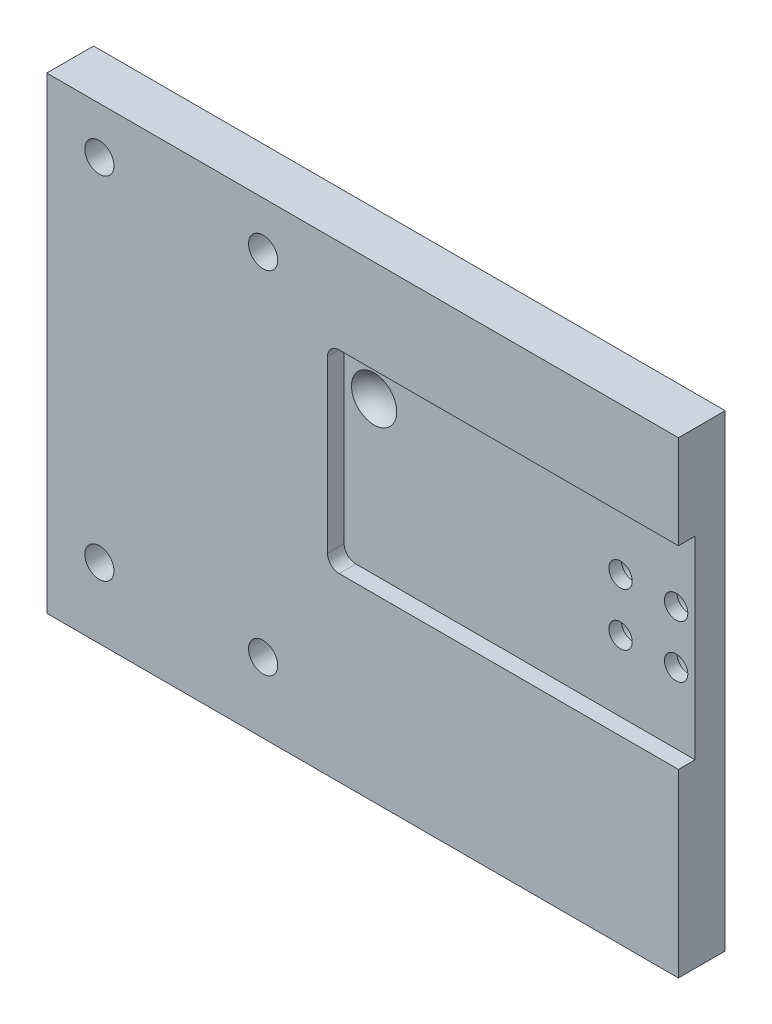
from build123d import *
from OCP.BRepFilletAPI import BRepFilletAPI_MakeChamfer

# Parameters (mm, degrees)
SKETCH2_W           = 171.45
SKETCH2_H           = 127
SKETCH2_R           = 3.9624
SKETCH2_R_2         = 3.175
BOSS_EXTRUDE1_DEPTH = 6.35
SKETCH3_R           = 3.175
CUT_EXTRUDE1_DEPTH  = 15.875
SKETCH4_W           = 95.25
SKETCH4_H           = 52.578
CUT_EXTRUDE2_DEPTH  = 4.5212
FILLET1_R           = 3.175
SKETCH6_R           = 4.7625
CUT_EXTRUDE3_DEPTH  = 4.7752
CHAMFER1_SIZE       = 1.778
CHAMFER1_SIZE2      = 2.95908892


with BuildPart() as part:
    # Sketch2 → Boss-Extrude1 (new, symmetric)
    with BuildSketch(Plane.XY):
        with Locations((85.725, 63.5)):
            Rectangle(SKETCH2_W, SKETCH2_H)
        with Locations((14.2748, 19.05)):
            Circle(SKETCH2_R, mode=Mode.SUBTRACT)
        with Locations((58.7248, 19.05)):
            Circle(SKETCH2_R, mode=Mode.SUBTRACT)
        with Locations((58.7248, 114.3)):
            Circle(SKETCH2_R, mode=Mode.SUBTRACT)
        with Locations((14.2748, 114.3)):
            Circle(SKETCH2_R, mode=Mode.SUBTRACT)
        with Locations((151.2062, 68.1736)):
            Circle(SKETCH2_R_2, mode=Mode.SUBTRACT)
        with Locations((166.2938, 68.1736)):
            Circle(SKETCH2_R_2, mode=Mode.SUBTRACT)
        with Locations((166.2938, 82.4484)):
            Circle(SKETCH2_R_2, mode=Mode.SUBTRACT)
        with Locations((151.2062, 82.4484)):
            Circle(SKETCH2_R_2, mode=Mode.SUBTRACT)
    extrude(amount=BOSS_EXTRUDE1_DEPTH, both=True)

    # Sketch3 → Cut-Extrude1 (cut)
    with BuildSketch(Plane.XZ):
        with Locations(Location((50.0126, 0, 0), (0, 0, 270))):
            Circle(SKETCH3_R)
        with Locations(Location((75.4126, 0, 0), (0, 0, 270))):
            Circle(SKETCH3_R)
        with Locations(Location((100.8126, 0, 0), (0, 0, 270))):
            Circle(SKETCH3_R)
        with Locations(Location((126.2126, 0, 0), (0, 0, 270))):
            Circle(SKETCH3_R)
    extrude(amount=-CUT_EXTRUDE1_DEPTH, mode=Mode.SUBTRACT)

    # Sketch4 → Cut-Extrude2 (cut)
    with BuildSketch(Plane.XY.offset(6.35)):
        with Locations((123.825, 75.311)):
            Rectangle(SKETCH4_W, SKETCH4_H)
    extrude(amount=-CUT_EXTRUDE2_DEPTH, mode=Mode.SUBTRACT)

    # Fillet1
    fillet1_edges = [part.edges().sort_by_distance(p)[0] for p in [
        (76.2, 49.022, 4.0894),
        (76.2, 101.6, 4.0894),
    ]]
    fillet(fillet1_edges, radius=FILLET1_R)

    # Sketch6 → Cut-Extrude3 (cut)
    with BuildSketch(Plane(origin=(0, 0, -6.35), x_dir=(-1, 0, 0), z_dir=(0, 0, -1))):
        with Locations((-151.2062, 68.1736)):
            Circle(SKETCH6_R)
        with Locations((-166.2938, 68.1736)):
            Circle(SKETCH6_R)
        with Locations((-166.2938, 82.4484)):
            Circle(SKETCH6_R)
        with Locations((-151.2062, 82.4484)):
            Circle(SKETCH6_R)
    extrude(amount=-CUT_EXTRUDE3_DEPTH, mode=Mode.SUBTRACT)

    # Chamfer1: one chamfer whose edges measure the first distance from different faces: ONE call of the kernel's chamfer builder (chamfer() names one face for all edges)
    chamfer1_edges_1 = [part.edges().sort_by_distance(p)[0] for p in [
        (50.0126, 15.875, 3.175),
    ]]
    chamfer1_side_1 = [part.faces().sort_by_distance(p)[0] for p in [
        (50.0126, 7.9375, 3.175),
    ]]
    chamfer1_edges_2 = [part.edges().sort_by_distance(p)[0] for p in [
        (75.4126, 15.875, 3.175),
    ]]
    chamfer1_side_2 = [part.faces().sort_by_distance(p)[0] for p in [
        (75.4126, 7.9375, 3.175),
    ]]
    chamfer1_edges_3 = [part.edges().sort_by_distance(p)[0] for p in [
        (100.8126, 15.875, 3.175),
    ]]
    chamfer1_side_3 = [part.faces().sort_by_distance(p)[0] for p in [
        (100.8126, 7.9375, 3.175),
    ]]
    chamfer1_edges_4 = [part.edges().sort_by_distance(p)[0] for p in [
        (126.2126, 15.875, 3.175),
    ]]
    chamfer1_side_4 = [part.faces().sort_by_distance(p)[0] for p in [
        (126.2126, 7.9375, 3.175),
    ]]
    chamfer1 = BRepFilletAPI_MakeChamfer(part.part.solid().wrapped)
    for e in chamfer1_edges_1:
        chamfer1.Add(CHAMFER1_SIZE, CHAMFER1_SIZE2, e.wrapped, chamfer1_side_1[0].wrapped)  # the first distance lies on this face
    for e in chamfer1_edges_2:
        chamfer1.Add(CHAMFER1_SIZE, CHAMFER1_SIZE2, e.wrapped, chamfer1_side_2[0].wrapped)  # the first distance lies on this face
    for e in chamfer1_edges_3:
        chamfer1.Add(CHAMFER1_SIZE, CHAMFER1_SIZE2, e.wrapped, chamfer1_side_3[0].wrapped)  # the first distance lies on this face
    for e in chamfer1_edges_4:
        chamfer1.Add(CHAMFER1_SIZE, CHAMFER1_SIZE2, e.wrapped, chamfer1_side_4[0].wrapped)  # the first distance lies on this face
    add(Compound.cast(chamfer1.Shape()), mode=Mode.REPLACE)

    # Sketch10 → Cut-Revolve1 (revolve, cut)
    with BuildSketch(Plane.XY.offset(6.35)):
        with BuildLine():
            Line((76.708, 90.3097), (91.948, 90.3097))
            ThreePointArc((91.948, 90.3097), (84.328, 97.9297), (76.708, 90.3097))
        make_face()
    revolve(axis=Axis((76.708, 90.3097, 6.35), (1, 0, 0)), mode=Mode.SUBTRACT)


solid = part.part
